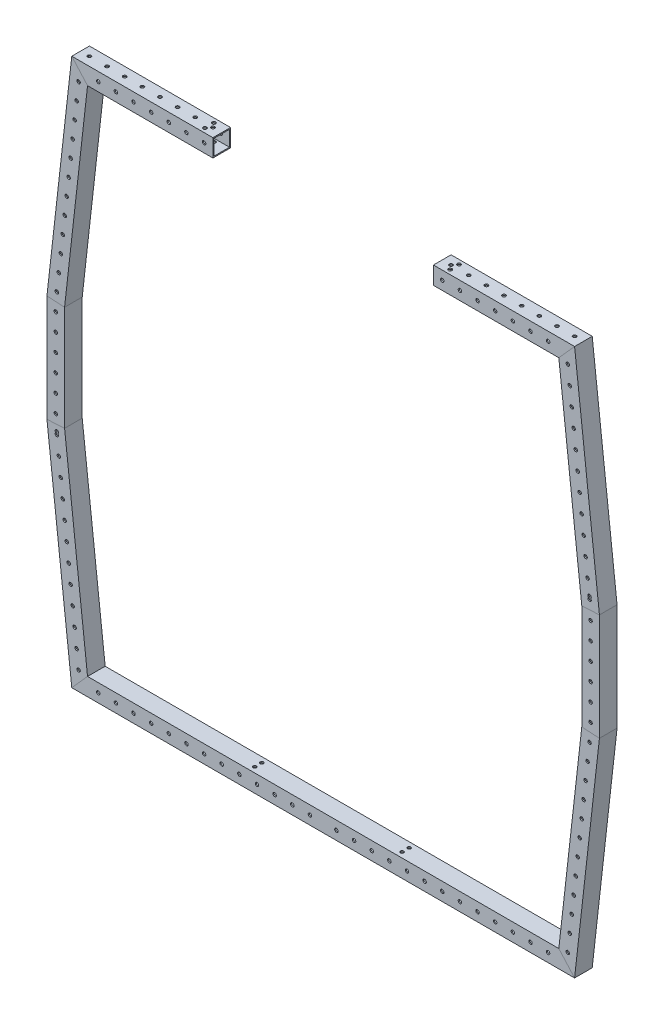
from build123d import *

# Parameters (mm, degrees)
SKETCH13_W         = 25.4
SKETCH13_H         = 25.4
SKETCH13_W_2       = 22.225
SKETCH13_H_2       = 22.225
SKETCH14_W         = 317.5
SKETCH14_H         = 696.501502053
CUT_EXTRUDE1_DEPTH = 872.196496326
SKETCH15_R         = 2.4892
CUT_EXTRUDE2_DEPTH = 1.5875
CUT_EXTRUDE3_REACH = 884.966
SKETCH16_R         = 2.4892
SKETCH17_R         = 2.4892
CUT_EXTRUDE4_DEPTH = 872.196496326
SKETCH18_R         = 2.4892
CUT_EXTRUDE5_DEPTH = 872.196496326
SKETCH20_R         = 2.5527
CUT_EXTRUDE6_DEPTH = 861.391594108
CUT_EXTRUDE7_REACH = 862.392
SKETCH21_R         = 2.38125


with BuildPart() as part:
    # Sweep1: sweep along a path in Sketch2
    with BuildLine(Plane.XY.offset(25.4)) as sweep1_path:
        Line((-385.016086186, -304.8), (-385.016086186, -457.2))
        Line((-385.016086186, -457.2), (-350.60318296, -762))
        Line((-350.60318296, -762), (350.60318296, -762))
        Line((350.60318296, -762), (385.016086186, -457.2))
        Line((385.016086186, -457.2), (385.016086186, -304.8))
        Line((385.016086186, -304.8), (350.60318296, 0))
        Line((350.60318296, 0), (-350.60318296, 0))
        Line((-350.60318296, 0), (-385.016086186, -304.8))
    # Sketch13 → Sweep1 (sweep)
    with BuildSketch(Plane(origin=(0, 0, 0), x_dir=(0, 0, -1), z_dir=(1, 0, 0))):
        with Locations((-25.4, 0)):
            Rectangle(SKETCH13_W, SKETCH13_H)
        with Locations((-25.4, 0)):
            Rectangle(SKETCH13_W_2, SKETCH13_H_2, mode=Mode.SUBTRACT)
    sweep(path=sweep1_path.line, transition=Transition.RIGHT)

    # Sketch14 → Cut-Extrude1 (cut, through all)
    with BuildSketch(Plane.XY.offset(38.1)):
        with Locations((0, -272.070576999)):
            Rectangle(SKETCH14_W, SKETCH14_H)
    extrude(amount=-CUT_EXTRUDE1_DEPTH, mode=Mode.SUBTRACT)

    # Sketch15 → Cut-Extrude2 (cut)
    with BuildSketch(Plane.XZ.offset(774.7)):
        with Locations(Location((-349.25, 25.4, 0), (0, 0, 270))):
            Circle(SKETCH15_R)
        with Locations(Location((-323.85, 25.4, 0), (0, 0, 270))):
            Circle(SKETCH15_R)
        with Locations(Location((-298.45, 25.4, 0), (0, 0, 270))):
            Circle(SKETCH15_R)
        with Locations(Location((-273.05, 25.4, 0), (0, 0, 270))):
            Circle(SKETCH15_R)
        with Locations(Location((-247.65, 25.4, 0), (0, 0, 270))):
            Circle(SKETCH15_R)
        with Locations(Location((-222.25, 25.4, 0), (0, 0, 270))):
            Circle(SKETCH15_R)
        with Locations(Location((-196.85, 25.4, 0), (0, 0, 270))):
            Circle(SKETCH15_R)
        with Locations(Location((-171.45, 25.4, 0), (0, 0, 270))):
            Circle(SKETCH15_R)
        with Locations(Location((-146.05, 25.4, 0), (0, 0, 270))):
            Circle(SKETCH15_R)
        with Locations(Location((-120.65, 25.4, 0), (0, 0, 270))):
            Circle(SKETCH15_R)
        with Locations(Location((-95.25, 25.4, 0), (0, 0, 270))):
            Circle(SKETCH15_R)
        with Locations(Location((-69.85, 25.4, 0), (0, 0, 270))):
            Circle(SKETCH15_R)
        with Locations(Location((-44.45, 25.4, 0), (0, 0, 270))):
            Circle(SKETCH15_R)
        with Locations(Location((-19.05, 25.4, 0), (0, 0, 270))):
            Circle(SKETCH15_R)
        with Locations(Location((19.05, 25.4, 0), (0, 0, 270))):
            Circle(SKETCH15_R)
        with Locations(Location((44.45, 25.4, 0), (0, 0, 270))):
            Circle(SKETCH15_R)
        with Locations(Location((69.85, 25.4, 0), (0, 0, 270))):
            Circle(SKETCH15_R)
        with Locations(Location((95.25, 25.4, 0), (0, 0, 270))):
            Circle(SKETCH15_R)
        with Locations(Location((120.65, 25.4, 0), (0, 0, 270))):
            Circle(SKETCH15_R)
        with Locations(Location((146.05, 25.4, 0), (0, 0, 270))):
            Circle(SKETCH15_R)
        with Locations(Location((171.45, 25.4, 0), (0, 0, 270))):
            Circle(SKETCH15_R)
        with Locations(Location((196.85, 25.4, 0), (0, 0, 270))):
            Circle(SKETCH15_R)
        with Locations(Location((222.25, 25.4, 0), (0, 0, 270))):
            Circle(SKETCH15_R)
        with Locations(Location((247.65, 25.4, 0), (0, 0, 270))):
            Circle(SKETCH15_R)
        with Locations(Location((273.05, 25.4, 0), (0, 0, 270))):
            Circle(SKETCH15_R)
        with Locations(Location((298.45, 25.4, 0), (0, 0, 270))):
            Circle(SKETCH15_R)
        with Locations(Location((323.85, 25.4, 0), (0, 0, 270))):
            Circle(SKETCH15_R)
        with Locations(Location((349.25, 25.4, 0), (0, 0, 270))):
            Circle(SKETCH15_R)
    extrude(amount=-CUT_EXTRUDE2_DEPTH, mode=Mode.SUBTRACT)

    # Sketch16 → Cut-Extrude3 (cut, up to next)
    with BuildSketch(Plane(origin=(0, 12.7, 0), x_dir=(1, 0, 0), z_dir=(0, 1, 0)), mode=Mode.PRIVATE) as cut_extrude3_sk1:
        with Locations(Location((349.25, -25.4, 0), (0, 0, 90))):
            Circle(SKETCH16_R)
    cut_extrude3_tool1 = extrude(cut_extrude3_sk1.sketch, amount=-CUT_EXTRUDE3_REACH, mode=Mode.PRIVATE) & part.part
    # Sketch16 → Cut-Extrude3 (cut, up to next)
    with BuildSketch(Plane(origin=(0, 12.7, 0), x_dir=(1, 0, 0), z_dir=(0, 1, 0)), mode=Mode.PRIVATE) as cut_extrude3_sk2:
        with Locations(Location((323.85, -25.4, 0), (0, 0, 90))):
            Circle(SKETCH16_R)
    cut_extrude3_tool2 = extrude(cut_extrude3_sk2.sketch, amount=-CUT_EXTRUDE3_REACH, mode=Mode.PRIVATE) & part.part
    # Sketch16 → Cut-Extrude3 (cut, up to next)
    with BuildSketch(Plane(origin=(0, 12.7, 0), x_dir=(1, 0, 0), z_dir=(0, 1, 0)), mode=Mode.PRIVATE) as cut_extrude3_sk3:
        with Locations(Location((298.45, -25.4, 0), (0, 0, 90))):
            Circle(SKETCH16_R)
    cut_extrude3_tool3 = extrude(cut_extrude3_sk3.sketch, amount=-CUT_EXTRUDE3_REACH, mode=Mode.PRIVATE) & part.part
    # Sketch16 → Cut-Extrude3 (cut, up to next)
    with BuildSketch(Plane(origin=(0, 12.7, 0), x_dir=(1, 0, 0), z_dir=(0, 1, 0)), mode=Mode.PRIVATE) as cut_extrude3_sk4:
        with Locations(Location((273.05, -25.4, 0), (0, 0, 90))):
            Circle(SKETCH16_R)
    cut_extrude3_tool4 = extrude(cut_extrude3_sk4.sketch, amount=-CUT_EXTRUDE3_REACH, mode=Mode.PRIVATE) & part.part
    # Sketch16 → Cut-Extrude3 (cut, up to next)
    with BuildSketch(Plane(origin=(0, 12.7, 0), x_dir=(1, 0, 0), z_dir=(0, 1, 0)), mode=Mode.PRIVATE) as cut_extrude3_sk5:
        with Locations(Location((247.65, -25.4, 0), (0, 0, 90))):
            Circle(SKETCH16_R)
    cut_extrude3_tool5 = extrude(cut_extrude3_sk5.sketch, amount=-CUT_EXTRUDE3_REACH, mode=Mode.PRIVATE) & part.part
    # Sketch16 → Cut-Extrude3 (cut, up to next)
    with BuildSketch(Plane(origin=(0, 12.7, 0), x_dir=(1, 0, 0), z_dir=(0, 1, 0)), mode=Mode.PRIVATE) as cut_extrude3_sk6:
        with Locations(Location((222.25, -25.4, 0), (0, 0, 90))):
            Circle(SKETCH16_R)
    cut_extrude3_tool6 = extrude(cut_extrude3_sk6.sketch, amount=-CUT_EXTRUDE3_REACH, mode=Mode.PRIVATE) & part.part
    # Sketch16 → Cut-Extrude3 (cut, up to next)
    with BuildSketch(Plane(origin=(0, 12.7, 0), x_dir=(1, 0, 0), z_dir=(0, 1, 0)), mode=Mode.PRIVATE) as cut_extrude3_sk7:
        with Locations(Location((196.85, -25.4, 0), (0, 0, 90))):
            Circle(SKETCH16_R)
    cut_extrude3_tool7 = extrude(cut_extrude3_sk7.sketch, amount=-CUT_EXTRUDE3_REACH, mode=Mode.PRIVATE) & part.part
    # Sketch16 → Cut-Extrude3 (cut, up to next)
    with BuildSketch(Plane(origin=(0, 12.7, 0), x_dir=(1, 0, 0), z_dir=(0, 1, 0)), mode=Mode.PRIVATE) as cut_extrude3_sk8:
        with Locations(Location((171.45, -25.4, 0), (0, 0, 90))):
            Circle(SKETCH16_R)
    cut_extrude3_tool8 = extrude(cut_extrude3_sk8.sketch, amount=-CUT_EXTRUDE3_REACH, mode=Mode.PRIVATE) & part.part
    # Sketch16 → Cut-Extrude3 (cut, up to next)
    with BuildSketch(Plane(origin=(0, 12.7, 0), x_dir=(1, 0, 0), z_dir=(0, 1, 0)), mode=Mode.PRIVATE) as cut_extrude3_sk9:
        with Locations(Location((-171.45, -25.4, 0), (0, 0, 90))):
            Circle(SKETCH16_R)
    cut_extrude3_tool9 = extrude(cut_extrude3_sk9.sketch, amount=-CUT_EXTRUDE3_REACH, mode=Mode.PRIVATE) & part.part
    # Sketch16 → Cut-Extrude3 (cut, up to next)
    with BuildSketch(Plane(origin=(0, 12.7, 0), x_dir=(1, 0, 0), z_dir=(0, 1, 0)), mode=Mode.PRIVATE) as cut_extrude3_sk10:
        with Locations(Location((-196.85, -25.4, 0), (0, 0, 90))):
            Circle(SKETCH16_R)
    cut_extrude3_tool10 = extrude(cut_extrude3_sk10.sketch, amount=-CUT_EXTRUDE3_REACH, mode=Mode.PRIVATE) & part.part
    # Sketch16 → Cut-Extrude3 (cut, up to next)
    with BuildSketch(Plane(origin=(0, 12.7, 0), x_dir=(1, 0, 0), z_dir=(0, 1, 0)), mode=Mode.PRIVATE) as cut_extrude3_sk11:
        with Locations(Location((-222.25, -25.4, 0), (0, 0, 90))):
            Circle(SKETCH16_R)
    cut_extrude3_tool11 = extrude(cut_extrude3_sk11.sketch, amount=-CUT_EXTRUDE3_REACH, mode=Mode.PRIVATE) & part.part
    # Sketch16 → Cut-Extrude3 (cut, up to next)
    with BuildSketch(Plane(origin=(0, 12.7, 0), x_dir=(1, 0, 0), z_dir=(0, 1, 0)), mode=Mode.PRIVATE) as cut_extrude3_sk12:
        with Locations(Location((-247.65, -25.4, 0), (0, 0, 90))):
            Circle(SKETCH16_R)
    cut_extrude3_tool12 = extrude(cut_extrude3_sk12.sketch, amount=-CUT_EXTRUDE3_REACH, mode=Mode.PRIVATE) & part.part
    # Sketch16 → Cut-Extrude3 (cut, up to next)
    with BuildSketch(Plane(origin=(0, 12.7, 0), x_dir=(1, 0, 0), z_dir=(0, 1, 0)), mode=Mode.PRIVATE) as cut_extrude3_sk13:
        with Locations(Location((-273.05, -25.4, 0), (0, 0, 90))):
            Circle(SKETCH16_R)
    cut_extrude3_tool13 = extrude(cut_extrude3_sk13.sketch, amount=-CUT_EXTRUDE3_REACH, mode=Mode.PRIVATE) & part.part
    # Sketch16 → Cut-Extrude3 (cut, up to next)
    with BuildSketch(Plane(origin=(0, 12.7, 0), x_dir=(1, 0, 0), z_dir=(0, 1, 0)), mode=Mode.PRIVATE) as cut_extrude3_sk14:
        with Locations(Location((-298.45, -25.4, 0), (0, 0, 90))):
            Circle(SKETCH16_R)
    cut_extrude3_tool14 = extrude(cut_extrude3_sk14.sketch, amount=-CUT_EXTRUDE3_REACH, mode=Mode.PRIVATE) & part.part
    # Sketch16 → Cut-Extrude3 (cut, up to next)
    with BuildSketch(Plane(origin=(0, 12.7, 0), x_dir=(1, 0, 0), z_dir=(0, 1, 0)), mode=Mode.PRIVATE) as cut_extrude3_sk15:
        with Locations(Location((-323.85, -25.4, 0), (0, 0, 90))):
            Circle(SKETCH16_R)
    cut_extrude3_tool15 = extrude(cut_extrude3_sk15.sketch, amount=-CUT_EXTRUDE3_REACH, mode=Mode.PRIVATE) & part.part
    # Sketch16 → Cut-Extrude3 (cut, up to next)
    with BuildSketch(Plane(origin=(0, 12.7, 0), x_dir=(1, 0, 0), z_dir=(0, 1, 0)), mode=Mode.PRIVATE) as cut_extrude3_sk16:
        with Locations(Location((-349.25, -25.4, 0), (0, 0, 90))):
            Circle(SKETCH16_R)
    cut_extrude3_tool16 = extrude(cut_extrude3_sk16.sketch, amount=-CUT_EXTRUDE3_REACH, mode=Mode.PRIVATE) & part.part
    add(cut_extrude3_tool1.solids().sort_by_distance((349.25, 12.7, 25.4))[0], mode=Mode.SUBTRACT)
    add(cut_extrude3_tool2.solids().sort_by_distance((323.85, 12.7, 25.4))[0], mode=Mode.SUBTRACT)
    add(cut_extrude3_tool3.solids().sort_by_distance((298.45, 12.7, 25.4))[0], mode=Mode.SUBTRACT)
    add(cut_extrude3_tool4.solids().sort_by_distance((273.05, 12.7, 25.4))[0], mode=Mode.SUBTRACT)
    add(cut_extrude3_tool5.solids().sort_by_distance((247.65, 12.7, 25.4))[0], mode=Mode.SUBTRACT)
    add(cut_extrude3_tool6.solids().sort_by_distance((222.25, 12.7, 25.4))[0], mode=Mode.SUBTRACT)
    add(cut_extrude3_tool7.solids().sort_by_distance((196.85, 12.7, 25.4))[0], mode=Mode.SUBTRACT)
    add(cut_extrude3_tool8.solids().sort_by_distance((171.45, 12.7, 25.4))[0], mode=Mode.SUBTRACT)
    add(cut_extrude3_tool9.solids().sort_by_distance((-171.45, 12.7, 25.4))[0], mode=Mode.SUBTRACT)
    add(cut_extrude3_tool10.solids().sort_by_distance((-196.85, 12.7, 25.4))[0], mode=Mode.SUBTRACT)
    add(cut_extrude3_tool11.solids().sort_by_distance((-222.25, 12.7, 25.4))[0], mode=Mode.SUBTRACT)
    add(cut_extrude3_tool12.solids().sort_by_distance((-247.65, 12.7, 25.4))[0], mode=Mode.SUBTRACT)
    add(cut_extrude3_tool13.solids().sort_by_distance((-273.05, 12.7, 25.4))[0], mode=Mode.SUBTRACT)
    add(cut_extrude3_tool14.solids().sort_by_distance((-298.45, 12.7, 25.4))[0], mode=Mode.SUBTRACT)
    add(cut_extrude3_tool15.solids().sort_by_distance((-323.85, 12.7, 25.4))[0], mode=Mode.SUBTRACT)
    add(cut_extrude3_tool16.solids().sort_by_distance((-349.25, 12.7, 25.4))[0], mode=Mode.SUBTRACT)

    # Sketch17 → Cut-Extrude4 (cut, through all)
    with BuildSketch(Plane(origin=(0, 0, 12.7), x_dir=(-1, 0, 0), z_dir=(0, 0, -1))):
        with Locations((-383.503662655, -287.877580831)):
            Circle(SKETCH17_R)
        with Locations((-383.503662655, -470.103432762)):
            Circle(SKETCH17_R)
        with Locations((383.503662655, -466.084446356)):
            Circle(SKETCH17_R)
        with Locations((383.503662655, -291.896567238)):
            Circle(SKETCH17_R)
    extrude(amount=-CUT_EXTRUDE4_DEPTH, mode=Mode.SUBTRACT)

    # Sketch18 → Cut-Extrude5 (cut, through all)
    with BuildSketch(Plane.XY.offset(38.1)):
        with Locations((-385.016086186, -342.9)):
            Circle(SKETCH18_R)
        with Locations((-385.016086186, -368.3)):
            Circle(SKETCH18_R)
        with Locations(Location((-383.503662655, -291.896567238, 0), (0, 0, 180))):
            Circle(SKETCH18_R)
        with Locations((-380.654025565, -266.656924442)):
            Circle(SKETCH18_R)
        with Locations((-377.804388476, -241.417281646)):
            Circle(SKETCH18_R)
        with Locations((-374.954751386, -216.17763885)):
            Circle(SKETCH18_R)
        with Locations((-372.105114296, -190.937996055)):
            Circle(SKETCH18_R)
        with Locations((-369.255477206, -165.698353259)):
            Circle(SKETCH18_R)
        with Locations((-366.405840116, -140.458710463)):
            Circle(SKETCH18_R)
        with Locations((-363.556203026, -115.219067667)):
            Circle(SKETCH18_R)
        with Locations((-360.706565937, -89.979424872)):
            Circle(SKETCH18_R)
        with Locations((-357.856928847, -64.739782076)):
            Circle(SKETCH18_R)
        with Locations((-355.007291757, -39.50013928)):
            Circle(SKETCH18_R)
        with Locations((-352.157654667, -14.260496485)):
            Circle(SKETCH18_R)
        with Locations((-385.016086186, -393.7)):
            Circle(SKETCH18_R)
        with Locations((-171.45, 0)):
            Circle(SKETCH18_R)
        with Locations((-196.85, 0)):
            Circle(SKETCH18_R)
        with Locations((-222.25, 0)):
            Circle(SKETCH18_R)
        with Locations((-247.65, 0)):
            Circle(SKETCH18_R)
        with Locations((-273.05, 0)):
            Circle(SKETCH18_R)
        with Locations((-298.45, 0)):
            Circle(SKETCH18_R)
        with Locations((-323.85, 0)):
            Circle(SKETCH18_R)
        with Locations(Location((323.85, 0, 0), (0, 0, 90))):
            Circle(SKETCH18_R)
        with Locations(Location((298.45, 0, 0), (0, 0, 90))):
            Circle(SKETCH18_R)
        with Locations(Location((273.05, 0, 0), (0, 0, 90))):
            Circle(SKETCH18_R)
        with Locations(Location((247.65, 0, 0), (0, 0, 90))):
            Circle(SKETCH18_R)
        with Locations(Location((222.25, 0, 0), (0, 0, 90))):
            Circle(SKETCH18_R)
        with Locations(Location((196.85, 0, 0), (0, 0, 90))):
            Circle(SKETCH18_R)
        with Locations(Location((171.45, 0, 0), (0, 0, 90))):
            Circle(SKETCH18_R)
        with Locations((-385.016086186, -419.1)):
            Circle(SKETCH18_R)
        with Locations((352.157654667, -14.260496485)):
            Circle(SKETCH18_R)
        with Locations((355.007291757, -39.50013928)):
            Circle(SKETCH18_R)
        with Locations((357.856928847, -64.739782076)):
            Circle(SKETCH18_R)
        with Locations((360.706565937, -89.979424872)):
            Circle(SKETCH18_R)
        with Locations((363.556203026, -115.219067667)):
            Circle(SKETCH18_R)
        with Locations((366.405840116, -140.458710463)):
            Circle(SKETCH18_R)
        with Locations((369.255477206, -165.698353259)):
            Circle(SKETCH18_R)
        with Locations((372.105114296, -190.937996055)):
            Circle(SKETCH18_R)
        with Locations((374.954751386, -216.17763885)):
            Circle(SKETCH18_R)
        with Locations((377.804388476, -241.417281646)):
            Circle(SKETCH18_R)
        with Locations((380.654025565, -266.656924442)):
            Circle(SKETCH18_R)
        with Locations((383.503662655, -291.896567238)):
            Circle(SKETCH18_R)
        with Locations((-385.016086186, -444.5)):
            Circle(SKETCH18_R)
        with Locations((-385.016086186, -317.5)):
            Circle(SKETCH18_R)
        with Locations(Location((383.503662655, -470.103432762, 0), (0, 0, 180))):
            Circle(SKETCH18_R)
        with Locations((380.654025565, -495.343075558)):
            Circle(SKETCH18_R)
        with Locations((377.804388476, -520.582718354)):
            Circle(SKETCH18_R)
        with Locations((374.954751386, -545.82236115)):
            Circle(SKETCH18_R)
        with Locations((372.105114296, -571.062003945)):
            Circle(SKETCH18_R)
        with Locations((369.255477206, -596.301646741)):
            Circle(SKETCH18_R)
        with Locations((366.405840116, -621.541289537)):
            Circle(SKETCH18_R)
        with Locations((363.556203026, -646.780932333)):
            Circle(SKETCH18_R)
        with Locations((360.706565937, -672.020575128)):
            Circle(SKETCH18_R)
        with Locations((357.856928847, -697.260217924)):
            Circle(SKETCH18_R)
        with Locations((355.007291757, -722.49986072)):
            Circle(SKETCH18_R)
        with Locations((352.157654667, -747.739503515)):
            Circle(SKETCH18_R)
        with Locations(Location((385.016086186, -317.5, 0), (0, 0, 180))):
            Circle(SKETCH18_R)
        with Locations(Location((385.016086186, -444.5, 0), (0, 0, 180))):
            Circle(SKETCH18_R)
        with Locations((171.45, -762)):
            Circle(SKETCH18_R)
        with Locations((196.85, -762)):
            Circle(SKETCH18_R)
        with Locations((222.25, -762)):
            Circle(SKETCH18_R)
        with Locations((247.65, -762)):
            Circle(SKETCH18_R)
        with Locations((273.05, -762)):
            Circle(SKETCH18_R)
        with Locations((298.45, -762)):
            Circle(SKETCH18_R)
        with Locations((323.85, -762)):
            Circle(SKETCH18_R)
        with Locations(Location((-323.85, -762, 0), (0, 0, 90))):
            Circle(SKETCH18_R)
        with Locations(Location((-298.45, -762, 0), (0, 0, 90))):
            Circle(SKETCH18_R)
        with Locations(Location((-273.05, -762, 0), (0, 0, 90))):
            Circle(SKETCH18_R)
        with Locations(Location((-247.65, -762, 0), (0, 0, 90))):
            Circle(SKETCH18_R)
        with Locations(Location((-222.25, -762, 0), (0, 0, 90))):
            Circle(SKETCH18_R)
        with Locations(Location((-196.85, -762, 0), (0, 0, 90))):
            Circle(SKETCH18_R)
        with Locations(Location((-171.45, -762, 0), (0, 0, 90))):
            Circle(SKETCH18_R)
        with Locations(Location((385.016086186, -419.1, 0), (0, 0, 180))):
            Circle(SKETCH18_R)
        with Locations(Location((-352.157654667, -747.739503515, 0), (0, 0, 180))):
            Circle(SKETCH18_R)
        with Locations(Location((-355.007291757, -722.49986072, 0), (0, 0, 180))):
            Circle(SKETCH18_R)
        with Locations(Location((-357.856928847, -697.260217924, 0), (0, 0, 180))):
            Circle(SKETCH18_R)
        with Locations(Location((-360.706565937, -672.020575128, 0), (0, 0, 180))):
            Circle(SKETCH18_R)
        with Locations(Location((-363.556203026, -646.780932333, 0), (0, 0, 180))):
            Circle(SKETCH18_R)
        with Locations(Location((-366.405840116, -621.541289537, 0), (0, 0, 180))):
            Circle(SKETCH18_R)
        with Locations(Location((-369.255477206, -596.301646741, 0), (0, 0, 180))):
            Circle(SKETCH18_R)
        with Locations(Location((-372.105114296, -571.062003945, 0), (0, 0, 180))):
            Circle(SKETCH18_R)
        with Locations(Location((-374.954751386, -545.82236115, 0), (0, 0, 180))):
            Circle(SKETCH18_R)
        with Locations(Location((-377.804388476, -520.582718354, 0), (0, 0, 180))):
            Circle(SKETCH18_R)
        with Locations(Location((-380.654025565, -495.343075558, 0), (0, 0, 180))):
            Circle(SKETCH18_R)
        with Locations((-383.503662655, -470.103432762)):
            Circle(SKETCH18_R)
        with Locations(Location((385.016086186, -393.7, 0), (0, 0, 180))):
            Circle(SKETCH18_R)
        with Locations(Location((-146.05, -762, 0), (0, 0, 90))):
            Circle(SKETCH18_R)
        with Locations(Location((-120.65, -762, 0), (0, 0, 90))):
            Circle(SKETCH18_R)
        with Locations(Location((-95.25, -762, 0), (0, 0, 90))):
            Circle(SKETCH18_R)
        with Locations(Location((-69.85, -762, 0), (0, 0, 90))):
            Circle(SKETCH18_R)
        with Locations(Location((-44.45, -762, 0), (0, 0, 90))):
            Circle(SKETCH18_R)
        with Locations(Location((-19.05, -762, 0), (0, 0, 90))):
            Circle(SKETCH18_R)
        with Locations((146.05, -762)):
            Circle(SKETCH18_R)
        with Locations((120.65, -762)):
            Circle(SKETCH18_R)
        with Locations((95.25, -762)):
            Circle(SKETCH18_R)
        with Locations((69.85, -762)):
            Circle(SKETCH18_R)
        with Locations((44.45, -762)):
            Circle(SKETCH18_R)
        with Locations((19.05, -762)):
            Circle(SKETCH18_R)
        with Locations(Location((385.016086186, -368.3, 0), (0, 0, 180))):
            Circle(SKETCH18_R)
        with Locations(Location((385.016086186, -342.9, 0), (0, 0, 180))):
            Circle(SKETCH18_R)
    extrude(amount=-CUT_EXTRUDE5_DEPTH, mode=Mode.SUBTRACT)

    # Sketch20 → Cut-Extrude6 (cut, through all)
    with BuildSketch(Plane.XZ.offset(12.7)):
        with Locations((176.53762, 31.75)):
            Circle(SKETCH20_R)
        with Locations((176.53762, 19.05)):
            Circle(SKETCH20_R)
        with Locations(Location((-176.53762, 31.75, 0), (0, 0, 180))):
            Circle(SKETCH20_R)
        with Locations(Location((-176.53762, 19.05, 0), (0, 0, 180))):
            Circle(SKETCH20_R)
    extrude(amount=-CUT_EXTRUDE6_DEPTH, mode=Mode.SUBTRACT)

    # Sketch21 → Cut-Extrude7 (cut, up to next)
    with BuildSketch(Plane(origin=(0, -749.3, 0), x_dir=(1, 0, 0), z_dir=(0, 1, 0)), mode=Mode.PRIVATE) as cut_extrude7_sk1:
        with Locations(Location((-106.08436592, -30.48, 0), (0, 0, 270))):
            Circle(SKETCH21_R)
    cut_extrude7_tool1 = extrude(cut_extrude7_sk1.sketch, amount=-CUT_EXTRUDE7_REACH, mode=Mode.PRIVATE) & part.part
    # Sketch21 → Cut-Extrude7 (cut, up to next)
    with BuildSketch(Plane(origin=(0, -749.3, 0), x_dir=(1, 0, 0), z_dir=(0, 1, 0)), mode=Mode.PRIVATE) as cut_extrude7_sk2:
        with Locations(Location((-106.08436592, -20.32, 0), (0, 0, 270))):
            Circle(SKETCH21_R)
    cut_extrude7_tool2 = extrude(cut_extrude7_sk2.sketch, amount=-CUT_EXTRUDE7_REACH, mode=Mode.PRIVATE) & part.part
    # Sketch21 → Cut-Extrude7 (cut, up to next)
    with BuildSketch(Plane(origin=(0, -749.3, 0), x_dir=(1, 0, 0), z_dir=(0, 1, 0)), mode=Mode.PRIVATE) as cut_extrude7_sk3:
        with Locations(Location((106.00563408, -30.48, 0), (0, 0, 270))):
            Circle(SKETCH21_R)
    cut_extrude7_tool3 = extrude(cut_extrude7_sk3.sketch, amount=-CUT_EXTRUDE7_REACH, mode=Mode.PRIVATE) & part.part
    # Sketch21 → Cut-Extrude7 (cut, up to next)
    with BuildSketch(Plane(origin=(0, -749.3, 0), x_dir=(1, 0, 0), z_dir=(0, 1, 0)), mode=Mode.PRIVATE) as cut_extrude7_sk4:
        with Locations(Location((106.00563408, -20.32, 0), (0, 0, 270))):
            Circle(SKETCH21_R)
    cut_extrude7_tool4 = extrude(cut_extrude7_sk4.sketch, amount=-CUT_EXTRUDE7_REACH, mode=Mode.PRIVATE) & part.part
    add(cut_extrude7_tool1.solids().sort_by_distance((-106.084366, -749.3, 30.48))[0], mode=Mode.SUBTRACT)
    add(cut_extrude7_tool2.solids().sort_by_distance((-106.084366, -749.3, 20.32))[0], mode=Mode.SUBTRACT)
    add(cut_extrude7_tool3.solids().sort_by_distance((106.005634, -749.3, 30.48))[0], mode=Mode.SUBTRACT)
    add(cut_extrude7_tool4.solids().sort_by_distance((106.005634, -749.3, 20.32))[0], mode=Mode.SUBTRACT)


solid = part.part
